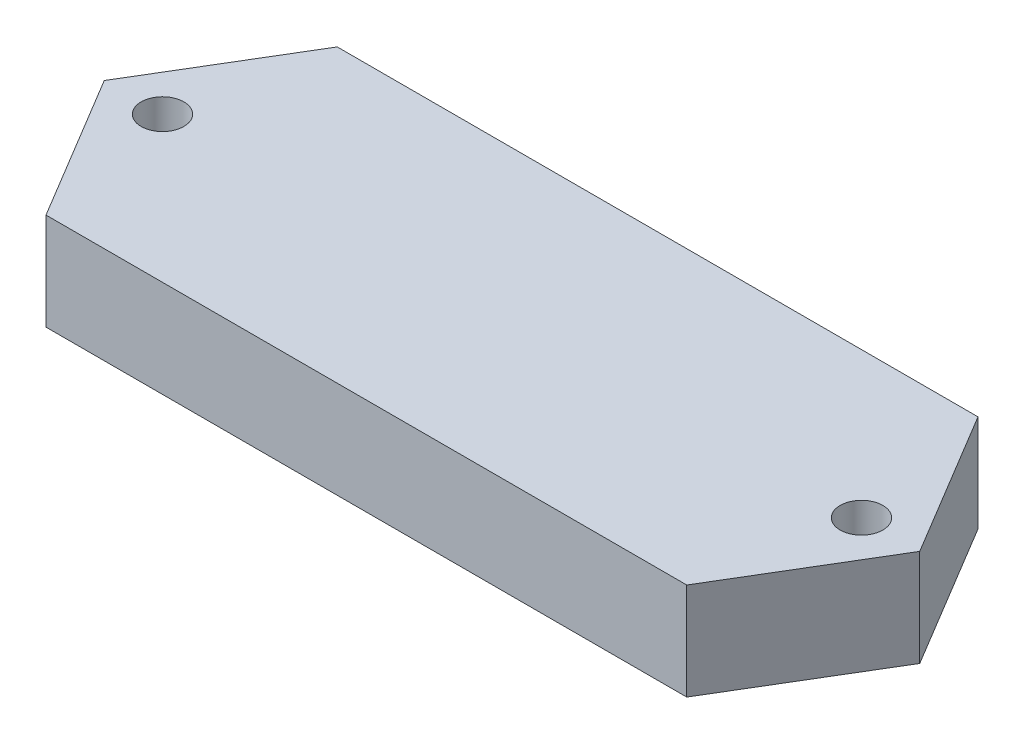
from build123d import *

# Parameters (mm, degrees)
SKETCH_1_W      = 33
SKETCH_1_H      = 15
SKETCH_1_R      = 1.1
EXTRUDE_1_DEPTH = 5


with BuildPart() as part:
    # Sketch 1 → Extrude 1 (new body)
    # profile 1 of 3: a face of its own
    with BuildSketch(Plane(origin=(0, 0, 0), x_dir=(1, 0, 0), z_dir=(0, 1, 0))):
        Rectangle(SKETCH_1_W, SKETCH_1_H)
    # profile 2 of 3: a face of its own
    with BuildSketch(Plane(origin=(0, 0, 0), x_dir=(1, 0, 0), z_dir=(0, 1, 0))):
        Polygon((-21, 0), (-16.5, 7.5), (-16.5, -7.5), align=None)
        with Locations(Location((-18, 0, 0), (0, 0, 270))):
            Circle(SKETCH_1_R, mode=Mode.SUBTRACT)
    # profile 3 of 3: a face of its own
    with BuildSketch(Plane(origin=(0, 0, 0), x_dir=(1, 0, 0), z_dir=(0, 1, 0))):
        Polygon((16.5, 7.5), (16.5, -7.5), (21, 0), align=None)
        with Locations(Location((18, 0, 0), (0, 0, 270))):
            Circle(SKETCH_1_R, mode=Mode.SUBTRACT)
    extrude(amount=EXTRUDE_1_DEPTH)


solid = part.part
